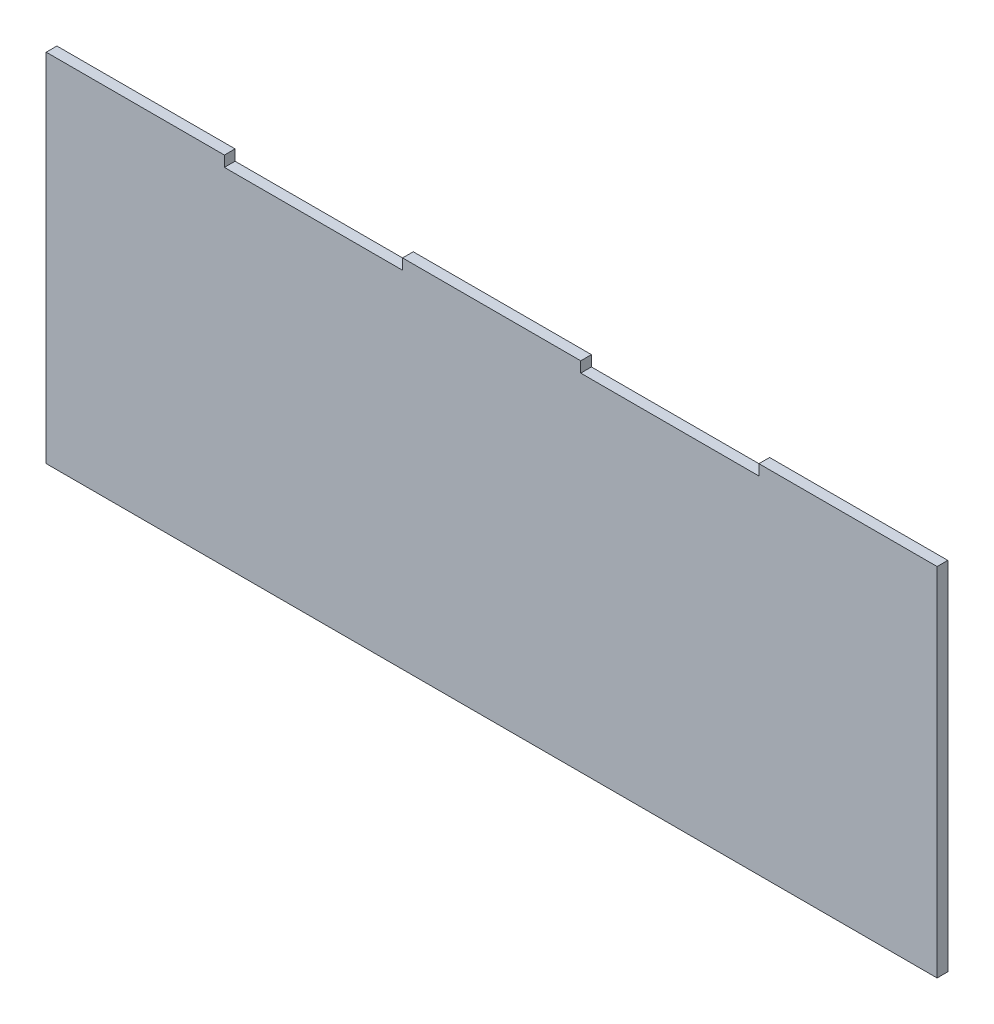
from build123d import *

# Parameters (mm, degrees)
BOSS_EXTRUDE1_DEPTH = 6


with BuildPart() as part:
    # Sketch1 → Boss-Extrude1 (new body)
    with BuildSketch(Plane.XY):
        Polygon((-394.006849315, 214.04109589), (-394.006849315, 208.04109589), (-294.006849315, 208.04109589), (-294.006849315, 214.04109589), (-194.006849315, 214.04109589), (-194.006849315, 208.04109589), (-94.006849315, 208.04109589), (-94.006849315, 214.04109589), (5.993150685, 214.04109589), (5.993150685, 14.04109589), (-494.006849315, 14.04109589), (-494.006849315, 214.04109589), align=None)
    extrude(amount=BOSS_EXTRUDE1_DEPTH)


solid = part.part
